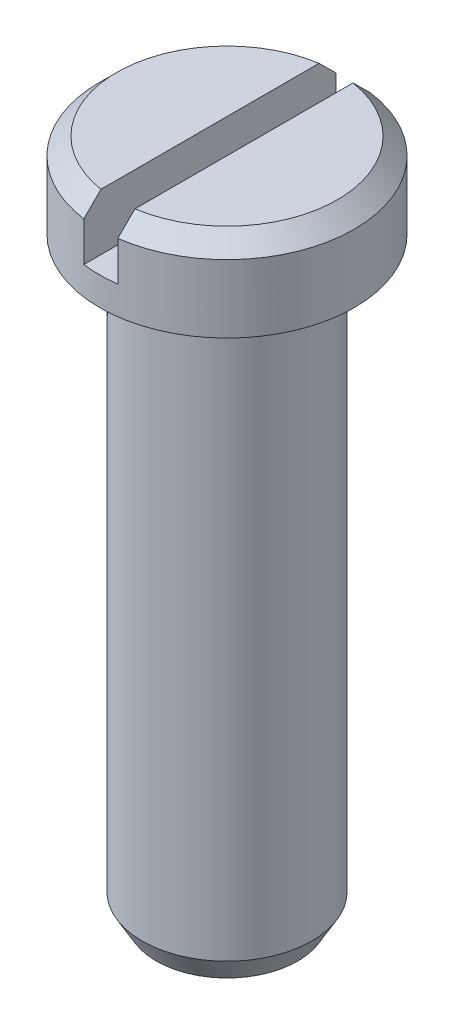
ISO-10303-21;
HEADER;
FILE_DESCRIPTION(('STEP AP214'),'2;1');
FILE_NAME('part.step','',(''),(''),'','','');
FILE_SCHEMA(('AUTOMOTIVE_DESIGN { 1 0 10303 214 1 1 1 1 }'));
ENDSEC;
DATA;
#1=APPLICATION_CONTEXT('core data for automotive mechanical design processes');
#2=APPLICATION_PROTOCOL_DEFINITION('international standard','automotive_design',2000,#1);
#3=PRODUCT_CONTEXT('',#1,'mechanical');
#4=PRODUCT('Part','Part','',(#3));
#5=PRODUCT_RELATED_PRODUCT_CATEGORY('part','',(#4));
#6=PRODUCT_DEFINITION_FORMATION('','',#4);
#7=PRODUCT_DEFINITION_CONTEXT('part definition',#1,'design');
#8=PRODUCT_DEFINITION('design','',#6,#7);
#9=PRODUCT_DEFINITION_SHAPE('','',#8);
#10=(LENGTH_UNIT() NAMED_UNIT(*) SI_UNIT(.MILLI.,.METRE.));
#11=(NAMED_UNIT(*) PLANE_ANGLE_UNIT() SI_UNIT($,.RADIAN.));
#12=(NAMED_UNIT(*) SI_UNIT($,.STERADIAN.) SOLID_ANGLE_UNIT());
#13=UNCERTAINTY_MEASURE_WITH_UNIT(LENGTH_MEASURE(1.E-05),#10,'distance_accuracy_value','');
#14=(GEOMETRIC_REPRESENTATION_CONTEXT(3) GLOBAL_UNCERTAINTY_ASSIGNED_CONTEXT((#13)) GLOBAL_UNIT_ASSIGNED_CONTEXT((#10,
#11,#12)) REPRESENTATION_CONTEXT('',''));
#15=CARTESIAN_POINT('',(0.,0.,0.));
#16=DIRECTION('',(0.,0.,1.));
#17=DIRECTION('',(1.,0.,0.));
#18=AXIS2_PLACEMENT_3D('',#15,#16,#17);
#19=CARTESIAN_POINT('',(0.,12.,0.));
#20=DIRECTION('',(0.,1.,0.));
#21=DIRECTION('',(0.,0.,1.));
#22=AXIS2_PLACEMENT_3D('',#19,#20,#21);
#23=PLANE('',#22);
#24=DIRECTION('',(0.,0.,1.));
#25=VECTOR('',#24,1.);
#26=CARTESIAN_POINT('',(-0.3,12.,0.));
#27=LINE('',#26,#25);
#28=CARTESIAN_POINT('',(-0.3,12.,-1.92678488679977));
#29=VERTEX_POINT('',#28);
#30=CARTESIAN_POINT('',(-0.3,12.,1.92678488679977));
#31=VERTEX_POINT('',#30);
#32=EDGE_CURVE('E110',#29,#31,#27,.T.);
#33=ORIENTED_EDGE('',*,*,#32,.F.);
#34=CARTESIAN_POINT('',(0.,12.,0.));
#35=DIRECTION('',(0.,1.,0.));
#36=DIRECTION('',(0.,0.,1.));
#37=AXIS2_PLACEMENT_3D('',#34,#35,#36);
#38=CIRCLE('',#37,1.95);
#39=EDGE_CURVE('E11',#29,#31,#38,.T.);
#40=ORIENTED_EDGE('',*,*,#39,.T.);
#41=EDGE_LOOP('',(#33,#40));
#42=FACE_BOUND('',#41,.T.);
#43=ADVANCED_FACE('F35',(#42),#23,.T.);
#44=CARTESIAN_POINT('',(0.,12.,0.));
#45=DIRECTION('',(0.,-1.,0.));
#46=DIRECTION('',(0.,0.,-1.));
#47=AXIS2_PLACEMENT_3D('',#44,#45,#46);
#48=CYLINDRICAL_SURFACE('',#47,1.5);
#49=CARTESIAN_POINT('',(0.,0.433012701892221,0.));
#50=DIRECTION('',(0.,1.,0.));
#51=DIRECTION('',(0.,0.,1.));
#52=AXIS2_PLACEMENT_3D('',#49,#50,#51);
#53=CIRCLE('',#52,1.5);
#54=CARTESIAN_POINT('',(0.,0.433012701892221,1.5));
#55=VERTEX_POINT('',#54);
#56=EDGE_CURVE('E123',#55,#55,#53,.T.);
#57=ORIENTED_EDGE('',*,*,#56,.T.);
#58=EDGE_LOOP('',(#57));
#59=FACE_BOUND('',#58,.T.);
#60=CARTESIAN_POINT('',(0.,10.5,0.));
#61=DIRECTION('',(0.,1.,0.));
#62=DIRECTION('',(0.,0.,1.));
#63=AXIS2_PLACEMENT_3D('',#60,#61,#62);
#64=CIRCLE('',#63,1.5);
#65=CARTESIAN_POINT('',(0.,10.5,1.5));
#66=VERTEX_POINT('',#65);
#67=EDGE_CURVE('E129',#66,#66,#64,.T.);
#68=ORIENTED_EDGE('',*,*,#67,.F.);
#69=EDGE_LOOP('',(#68));
#70=FACE_BOUND('',#69,.T.);
#71=ADVANCED_FACE('F37',(#59,#70),#48,.T.);
#72=CARTESIAN_POINT('',(0.,0.,0.));
#73=DIRECTION('',(0.,1.,0.));
#74=DIRECTION('',(0.,0.,1.));
#75=AXIS2_PLACEMENT_3D('',#72,#73,#74);
#76=PLANE('',#75);
#77=CARTESIAN_POINT('',(0.,0.,0.));
#78=DIRECTION('',(0.,1.,0.));
#79=DIRECTION('',(0.,0.,1.));
#80=AXIS2_PLACEMENT_3D('',#77,#78,#79);
#81=CIRCLE('',#80,1.25);
#82=CARTESIAN_POINT('',(0.,0.,1.25));
#83=VERTEX_POINT('',#82);
#84=EDGE_CURVE('E126',#83,#83,#81,.F.);
#85=ORIENTED_EDGE('',*,*,#84,.T.);
#86=EDGE_LOOP('',(#85));
#87=FACE_BOUND('',#86,.T.);
#88=ADVANCED_FACE('F193',(#87),#76,.F.);
#89=CARTESIAN_POINT('',(0.,0.433012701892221,0.));
#90=DIRECTION('',(0.,1.,0.));
#91=DIRECTION('',(0.,0.,1.));
#92=AXIS2_PLACEMENT_3D('',#89,#90,#91);
#93=CONICAL_SURFACE('',#92,1.5,0.5235987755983);
#94=ORIENTED_EDGE('',*,*,#84,.F.);
#95=EDGE_LOOP('',(#94));
#96=FACE_BOUND('',#95,.T.);
#97=ORIENTED_EDGE('',*,*,#56,.F.);
#98=EDGE_LOOP('',(#97));
#99=FACE_BOUND('',#98,.T.);
#100=ADVANCED_FACE('F211',(#96,#99),#93,.T.);
#101=CARTESIAN_POINT('',(-0.25,10.5,0.));
#102=DIRECTION('',(0.,1.,0.));
#103=DIRECTION('',(0.,0.,1.));
#104=AXIS2_PLACEMENT_3D('',#101,#102,#103);
#105=PLANE('',#104);
#106=CARTESIAN_POINT('',(0.,10.5,0.));
#107=DIRECTION('',(0.,-1.,0.));
#108=DIRECTION('',(0.,0.,-1.));
#109=AXIS2_PLACEMENT_3D('',#106,#107,#108);
#110=CIRCLE('',#109,2.25);
#111=CARTESIAN_POINT('',(0.,10.5,-2.25));
#112=VERTEX_POINT('',#111);
#113=EDGE_CURVE('E120',#112,#112,#110,.T.);
#114=ORIENTED_EDGE('',*,*,#113,.T.);
#115=EDGE_LOOP('',(#114));
#116=FACE_BOUND('',#115,.T.);
#117=ORIENTED_EDGE('',*,*,#67,.T.);
#118=EDGE_LOOP('',(#117));
#119=FACE_BOUND('',#118,.T.);
#120=ADVANCED_FACE('F202',(#116,#119),#105,.F.);
#121=CARTESIAN_POINT('',(0.,0.,0.));
#122=DIRECTION('',(0.,-1.,0.));
#123=DIRECTION('',(0.,0.,-1.));
#124=AXIS2_PLACEMENT_3D('',#121,#122,#123);
#125=CYLINDRICAL_SURFACE('',#124,2.25);
#126=DIRECTION('',(0.,-1.,0.));
#127=VECTOR('',#126,1.);
#128=CARTESIAN_POINT('',(0.3,0.,-2.22991031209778));
#129=LINE('',#128,#127);
#130=CARTESIAN_POINT('',(0.3,11.,-2.22991031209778));
#131=VERTEX_POINT('',#130);
#132=CARTESIAN_POINT('',(0.3,11.7,-2.22991031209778));
#133=VERTEX_POINT('',#132);
#134=EDGE_CURVE('E98',#131,#133,#129,.F.);
#135=ORIENTED_EDGE('',*,*,#134,.T.);
#136=CARTESIAN_POINT('',(0.,11.7,0.));
#137=DIRECTION('',(0.,1.,0.));
#138=DIRECTION('',(0.,0.,1.));
#139=AXIS2_PLACEMENT_3D('',#136,#137,#138);
#140=CIRCLE('',#139,2.25);
#141=CARTESIAN_POINT('',(0.3,11.7,2.22991031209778));
#142=VERTEX_POINT('',#141);
#143=EDGE_CURVE('E94',#133,#142,#140,.F.);
#144=ORIENTED_EDGE('',*,*,#143,.T.);
#145=DIRECTION('',(0.,-1.,0.));
#146=VECTOR('',#145,1.);
#147=CARTESIAN_POINT('',(0.3,0.,2.22991031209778));
#148=LINE('',#147,#146);
#149=CARTESIAN_POINT('',(0.3,11.,2.22991031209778));
#150=VERTEX_POINT('',#149);
#151=EDGE_CURVE('E86',#142,#150,#148,.T.);
#152=ORIENTED_EDGE('',*,*,#151,.T.);
#153=CARTESIAN_POINT('',(0.,11.,0.));
#154=DIRECTION('',(0.,1.,0.));
#155=DIRECTION('',(0.,0.,1.));
#156=AXIS2_PLACEMENT_3D('',#153,#154,#155);
#157=CIRCLE('',#156,2.25);
#158=CARTESIAN_POINT('',(-0.3,11.,2.22991031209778));
#159=VERTEX_POINT('',#158);
#160=EDGE_CURVE('E92',#159,#150,#157,.T.);
#161=ORIENTED_EDGE('',*,*,#160,.F.);
#162=DIRECTION('',(0.,-1.,0.));
#163=VECTOR('',#162,1.);
#164=CARTESIAN_POINT('',(-0.3,0.,2.22991031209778));
#165=LINE('',#164,#163);
#166=CARTESIAN_POINT('',(-0.3,11.7,2.22991031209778));
#167=VERTEX_POINT('',#166);
#168=EDGE_CURVE('E97',#159,#167,#165,.F.);
#169=ORIENTED_EDGE('',*,*,#168,.T.);
#170=CARTESIAN_POINT('',(0.,11.7,0.));
#171=DIRECTION('',(0.,1.,0.));
#172=DIRECTION('',(0.,0.,1.));
#173=AXIS2_PLACEMENT_3D('',#170,#171,#172);
#174=CIRCLE('',#173,2.25);
#175=CARTESIAN_POINT('',(-0.3,11.7,-2.22991031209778));
#176=VERTEX_POINT('',#175);
#177=EDGE_CURVE('E136',#167,#176,#174,.F.);
#178=ORIENTED_EDGE('',*,*,#177,.T.);
#179=DIRECTION('',(0.,-1.,0.));
#180=VECTOR('',#179,1.);
#181=CARTESIAN_POINT('',(-0.3,0.,-2.22991031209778));
#182=LINE('',#181,#180);
#183=CARTESIAN_POINT('',(-0.3,11.,-2.22991031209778));
#184=VERTEX_POINT('',#183);
#185=EDGE_CURVE('E118',#176,#184,#182,.T.);
#186=ORIENTED_EDGE('',*,*,#185,.T.);
#187=EDGE_CURVE('E109',#131,#184,#157,.T.);
#188=ORIENTED_EDGE('',*,*,#187,.F.);
#189=EDGE_LOOP('',(#135,#144,#152,#161,#169,#178,#186,#188));
#190=FACE_BOUND('',#189,.T.);
#191=ORIENTED_EDGE('',*,*,#113,.F.);
#192=EDGE_LOOP('',(#191));
#193=FACE_BOUND('',#192,.T.);
#194=ADVANCED_FACE('F89',(#190,#193),#125,.T.);
#195=DIRECTION('',(0.,0.,-1.));
#196=VECTOR('',#195,1.);
#197=CARTESIAN_POINT('',(0.3,12.,0.));
#198=LINE('',#197,#196);
#199=CARTESIAN_POINT('',(0.3,12.,1.92678488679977));
#200=VERTEX_POINT('',#199);
#201=CARTESIAN_POINT('',(0.3,12.,-1.92678488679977));
#202=VERTEX_POINT('',#201);
#203=EDGE_CURVE('E132',#200,#202,#198,.T.);
#204=ORIENTED_EDGE('',*,*,#203,.F.);
#205=CARTESIAN_POINT('',(0.,12.,0.));
#206=DIRECTION('',(0.,1.,0.));
#207=DIRECTION('',(0.,0.,1.));
#208=AXIS2_PLACEMENT_3D('',#205,#206,#207);
#209=CIRCLE('',#208,1.95);
#210=EDGE_CURVE('E205',#200,#202,#209,.T.);
#211=ORIENTED_EDGE('',*,*,#210,.T.);
#212=EDGE_LOOP('',(#204,#211));
#213=FACE_BOUND('',#212,.T.);
#214=ADVANCED_FACE('F189',(#213),#23,.T.);
#215=CARTESIAN_POINT('',(-0.3,11.,2.4803921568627));
#216=DIRECTION('',(0.,1.,0.));
#217=DIRECTION('',(0.,0.,1.));
#218=AXIS2_PLACEMENT_3D('',#215,#216,#217);
#219=PLANE('',#218);
#220=ORIENTED_EDGE('',*,*,#187,.T.);
#221=DIRECTION('',(0.,0.,1.));
#222=VECTOR('',#221,1.);
#223=CARTESIAN_POINT('',(-0.3,11.,-2.38914027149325));
#224=LINE('',#223,#222);
#225=EDGE_CURVE('E108',#184,#159,#224,.T.);
#226=ORIENTED_EDGE('',*,*,#225,.T.);
#227=ORIENTED_EDGE('',*,*,#160,.T.);
#228=DIRECTION('',(0.,0.,-1.));
#229=VECTOR('',#228,1.);
#230=CARTESIAN_POINT('',(0.3,11.,-2.38914027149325));
#231=LINE('',#230,#229);
#232=EDGE_CURVE('E105',#150,#131,#231,.T.);
#233=ORIENTED_EDGE('',*,*,#232,.T.);
#234=EDGE_LOOP('',(#220,#226,#227,#233));
#235=FACE_BOUND('',#234,.T.);
#236=ADVANCED_FACE('F104',(#235),#219,.T.);
#237=CARTESIAN_POINT('',(-0.3,11.,-2.38914027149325));
#238=DIRECTION('',(-1.,0.,0.));
#239=DIRECTION('',(0.,0.,1.));
#240=AXIS2_PLACEMENT_3D('',#237,#238,#239);
#241=PLANE('',#240);
#242=ORIENTED_EDGE('',*,*,#185,.F.);
#243=CARTESIAN_POINT('',(-0.3,11.7,-2.22991031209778));
#244=CARTESIAN_POINT('',(-0.3,11.7500377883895,-2.17942680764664));
#245=CARTESIAN_POINT('',(-0.3,11.8000566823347,-2.12892460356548));
#246=CARTESIAN_POINT('',(-0.3,11.9000566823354,-2.02788279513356));
#247=CARTESIAN_POINT('',(-0.3,11.9500377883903,-1.97734319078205));
#248=CARTESIAN_POINT('',(-0.3,12.,-1.92678488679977));
#249=B_SPLINE_CURVE_WITH_KNOTS('',3,(#243,#244,#245,#246,#247,#248),.UNSPECIFIED.,.F.,.F.,(4,2,
4),(0.,0.21323991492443,0.42647983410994),.UNSPECIFIED.);
#250=EDGE_CURVE('E43',#176,#29,#249,.T.);
#251=ORIENTED_EDGE('',*,*,#250,.T.);
#252=ORIENTED_EDGE('',*,*,#32,.T.);
#253=CARTESIAN_POINT('',(-0.3,12.,1.92678488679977));
#254=CARTESIAN_POINT('',(-0.3,11.9500377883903,1.97734319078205));
#255=CARTESIAN_POINT('',(-0.3,11.9000566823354,2.02788279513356));
#256=CARTESIAN_POINT('',(-0.3,11.8000566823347,2.12892460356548));
#257=CARTESIAN_POINT('',(-0.3,11.7500377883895,2.17942680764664));
#258=CARTESIAN_POINT('',(-0.3,11.7,2.22991031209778));
#259=B_SPLINE_CURVE_WITH_KNOTS('',3,(#253,#254,#255,#256,#257,#258),.UNSPECIFIED.,.F.,.F.,(4,2,
4),(0.,0.21323991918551,0.42647983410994),.UNSPECIFIED.);
#260=EDGE_CURVE('E169',#31,#167,#259,.T.);
#261=ORIENTED_EDGE('',*,*,#260,.T.);
#262=ORIENTED_EDGE('',*,*,#168,.F.);
#263=ORIENTED_EDGE('',*,*,#225,.F.);
#264=EDGE_LOOP('',(#242,#251,#252,#261,#262,#263));
#265=FACE_BOUND('',#264,.T.);
#266=ADVANCED_FACE('F161',(#265),#241,.F.);
#267=CARTESIAN_POINT('',(0.3,11.,-2.38914027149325));
#268=DIRECTION('',(1.,0.,0.));
#269=DIRECTION('',(0.,0.,-1.));
#270=AXIS2_PLACEMENT_3D('',#267,#268,#269);
#271=PLANE('',#270);
#272=ORIENTED_EDGE('',*,*,#151,.F.);
#273=CARTESIAN_POINT('',(0.3,11.7,2.22991031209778));
#274=CARTESIAN_POINT('',(0.3,11.7500377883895,2.17942680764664));
#275=CARTESIAN_POINT('',(0.3,11.8000566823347,2.12892460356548));
#276=CARTESIAN_POINT('',(0.3,11.9000566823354,2.02788279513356));
#277=CARTESIAN_POINT('',(0.3,11.9500377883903,1.97734319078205));
#278=CARTESIAN_POINT('',(0.3,12.,1.92678488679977));
#279=B_SPLINE_CURVE_WITH_KNOTS('',3,(#273,#274,#275,#276,#277,#278),.UNSPECIFIED.,.F.,.F.,(4,2,
4),(0.,0.21323991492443,0.42647983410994),.UNSPECIFIED.);
#280=EDGE_CURVE('E148',#142,#200,#279,.T.);
#281=ORIENTED_EDGE('',*,*,#280,.T.);
#282=ORIENTED_EDGE('',*,*,#203,.T.);
#283=CARTESIAN_POINT('',(0.3,12.,-1.92678488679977));
#284=CARTESIAN_POINT('',(0.3,11.9500377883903,-1.97734319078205));
#285=CARTESIAN_POINT('',(0.3,11.9000566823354,-2.02788279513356));
#286=CARTESIAN_POINT('',(0.3,11.8000566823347,-2.12892460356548));
#287=CARTESIAN_POINT('',(0.3,11.7500377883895,-2.17942680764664));
#288=CARTESIAN_POINT('',(0.3,11.7,-2.22991031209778));
#289=B_SPLINE_CURVE_WITH_KNOTS('',3,(#283,#284,#285,#286,#287,#288),.UNSPECIFIED.,.F.,.F.,(4,2,
4),(0.,0.21323991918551,0.42647983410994),.UNSPECIFIED.);
#290=EDGE_CURVE('E140',#202,#133,#289,.T.);
#291=ORIENTED_EDGE('',*,*,#290,.T.);
#292=ORIENTED_EDGE('',*,*,#134,.F.);
#293=ORIENTED_EDGE('',*,*,#232,.F.);
#294=EDGE_LOOP('',(#272,#281,#282,#291,#292,#293));
#295=FACE_BOUND('',#294,.T.);
#296=ADVANCED_FACE('F112',(#295),#271,.F.);
#297=CARTESIAN_POINT('',(0.,11.7,0.));
#298=DIRECTION('',(0.,-1.,0.));
#299=DIRECTION('',(0.,0.,-1.));
#300=AXIS2_PLACEMENT_3D('',#297,#298,#299);
#301=CONICAL_SURFACE('',#300,2.25,0.785398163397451);
#302=ORIENTED_EDGE('',*,*,#290,.F.);
#303=ORIENTED_EDGE('',*,*,#210,.F.);
#304=ORIENTED_EDGE('',*,*,#280,.F.);
#305=ORIENTED_EDGE('',*,*,#143,.F.);
#306=EDGE_LOOP('',(#302,#303,#304,#305));
#307=FACE_BOUND('',#306,.T.);
#308=ADVANCED_FACE('F154',(#307),#301,.T.);
#309=CARTESIAN_POINT('',(0.,11.7,0.));
#310=DIRECTION('',(0.,-1.,0.));
#311=DIRECTION('',(0.,0.,-1.));
#312=AXIS2_PLACEMENT_3D('',#309,#310,#311);
#313=CONICAL_SURFACE('',#312,2.25,0.785398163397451);
#314=ORIENTED_EDGE('',*,*,#260,.F.);
#315=ORIENTED_EDGE('',*,*,#39,.F.);
#316=ORIENTED_EDGE('',*,*,#250,.F.);
#317=ORIENTED_EDGE('',*,*,#177,.F.);
#318=EDGE_LOOP('',(#314,#315,#316,#317));
#319=FACE_BOUND('',#318,.T.);
#320=ADVANCED_FACE('F178',(#319),#313,.T.);
#321=CLOSED_SHELL('',(#43,#71,#88,#100,#120,#194,#214,#236,#266,#296,#308,#320));
#322=MANIFOLD_SOLID_BREP('B2',#321);
#323=ADVANCED_BREP_SHAPE_REPRESENTATION('',(#18,#322),#14);
#324=SHAPE_DEFINITION_REPRESENTATION(#9,#323);
ENDSEC;
END-ISO-10303-21;
